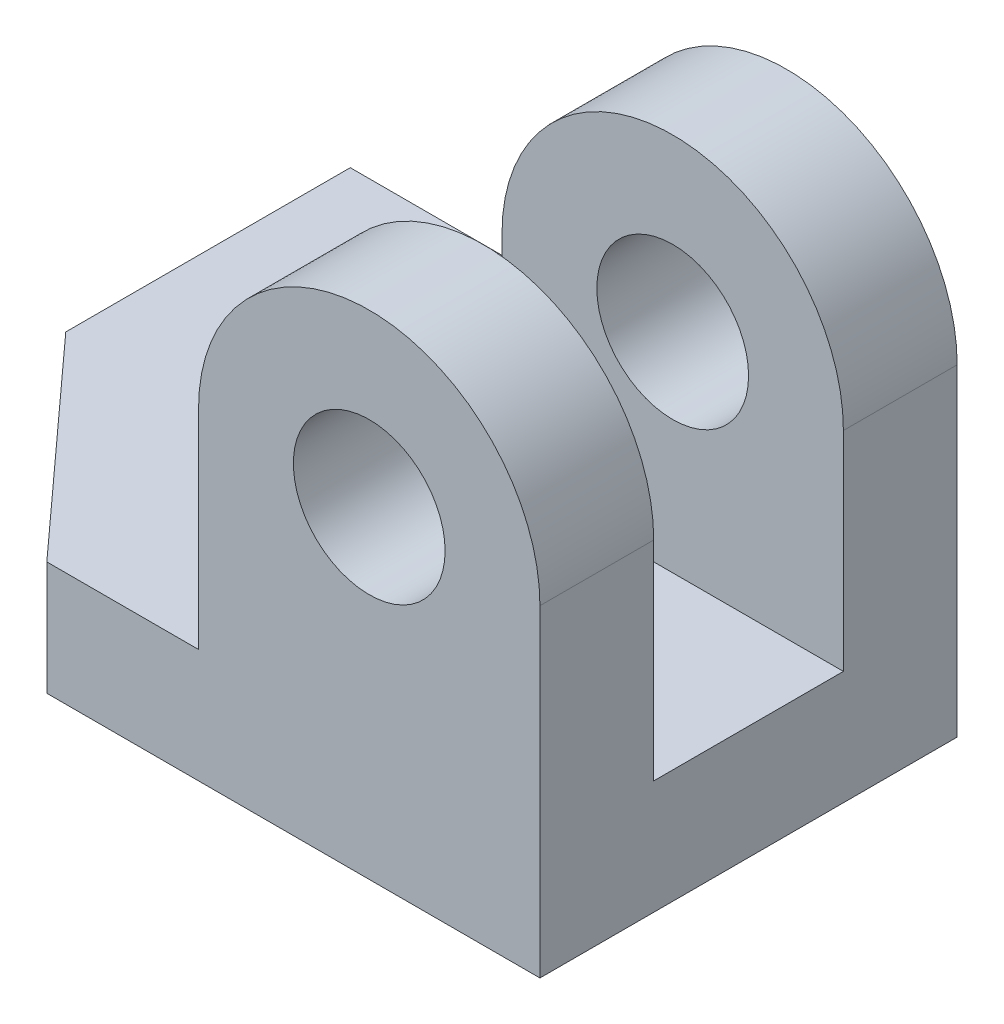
from build123d import *

# Parameters (mm, degrees)
EXTRUDE_1_DEPTH     = 15
SKETCH_2_W          = 45
SKETCH_2_H          = 15
EXTRUDE_2_DEPTH     = 50
FILLET_1_RADIUS     = 22.5
FILLET_1_LENGTH     = 15
FILLET_2_RADIUS     = 22.5
FILLET_2_LENGTH     = 15
SKETCH_3_R          = 10
CUT_EXTRUDE_1_DEPTH = 129.646803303


with BuildPart() as part:
    # Sketch 1 → Extrude 1 (new body)
    with BuildSketch(Plane(origin=(0, 0, 0), x_dir=(1, 0, 0), z_dir=(0, 1, 0))):
        Polygon((0, 55), (0, 65), (25, 65), (25, 55), (90, 55), (90, 0), (25, 0), (0, 27.5), align=None)
    extrude(amount=EXTRUDE_1_DEPTH)

    # Sketch 2 → Extrude 2 (add)
    with BuildSketch(Plane(origin=(0, 15, 0), x_dir=(1, 0, 0), z_dir=(0, 1, 0))):
        with Locations((67.5, 47.5)):
            Rectangle(SKETCH_2_W, SKETCH_2_H)
        with Locations((67.5, 7.5)):
            Rectangle(SKETCH_2_W, SKETCH_2_H)
    extrude(amount=EXTRUDE_2_DEPTH)

    # Fillet 1: full round fillet: the end face becomes a half cylinder, R = half its width
    fillet_1_face = Plane((67.5, 65, -7.5), x_dir=(0, 0, -1), z_dir=(0, 1, 0))  # on the end face: x along it, z out of the body
    fillet_1_slab = fillet_1_face.offset(-FILLET_1_RADIUS / 2) * Box(FILLET_1_LENGTH, 2 * FILLET_1_RADIUS, FILLET_1_RADIUS, mode=Mode.PRIVATE)  # the body's end, R deep
    fillet_1_round = Plane((67.5, 42.5, -7.5), x_dir=(0, 1, 0), z_dir=(0, 0, -1)) * Cylinder(FILLET_1_RADIUS, FILLET_1_LENGTH, mode=Mode.PRIVATE)  # its axis R under the face
    add(fillet_1_slab - fillet_1_round, mode=Mode.SUBTRACT)

    # Fillet 2: full round fillet: the end face becomes a half cylinder, R = half its width
    fillet_2_face = Plane((67.5, 65, -47.5), x_dir=(0, 0, 1), z_dir=(0, 1, 0))  # on the end face: x along it, z out of the body
    fillet_2_slab = fillet_2_face.offset(-FILLET_2_RADIUS / 2) * Box(FILLET_2_LENGTH, 2 * FILLET_2_RADIUS, FILLET_2_RADIUS, mode=Mode.PRIVATE)  # the body's end, R deep
    fillet_2_round = Plane((67.5, 42.5, -47.5), x_dir=(0, 1, 0), z_dir=(0, 0, 1)) * Cylinder(FILLET_2_RADIUS, FILLET_2_LENGTH, mode=Mode.PRIVATE)  # its axis R under the face
    add(fillet_2_slab - fillet_2_round, mode=Mode.SUBTRACT)

    # Sketch 3 → Cut-Extrude 1 (cut, through all)
    with BuildSketch(Plane.XY):
        with Locations((67.5, 42.5)):
            Circle(SKETCH_3_R)
    extrude(amount=-CUT_EXTRUDE_1_DEPTH, mode=Mode.SUBTRACT)


solid = part.part
